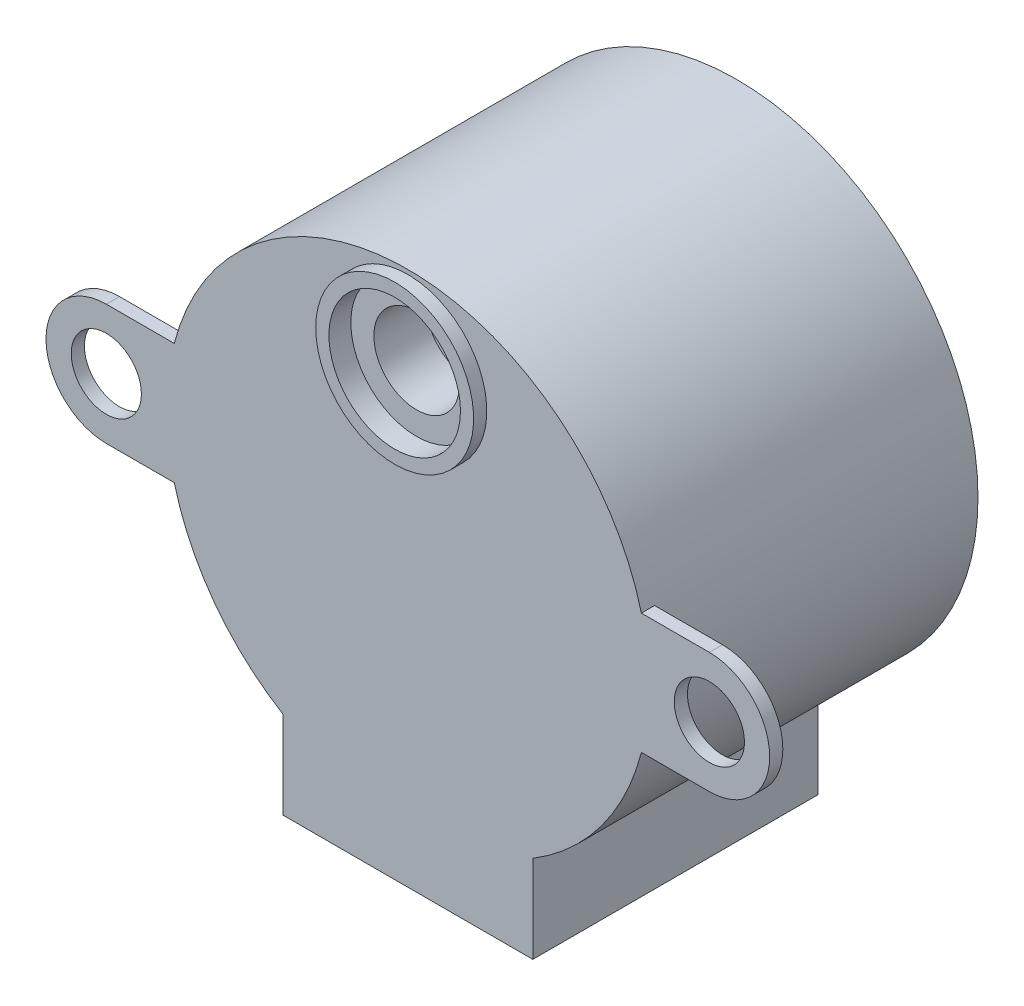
from build123d import *

# Parameters (mm, degrees)
SKETCH1_R           = 13.97
BOSS_EXTRUDE1_DEPTH = 19.05
BOSS_EXTRUDE2_DEPTH = 0.762
SKETCH3_R           = 2.032
CUT_EXTRUDE1_DEPTH  = 32.578084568
SKETCH6_R           = 4.572
BOSS_EXTRUDE3_DEPTH = 0.762
SKETCH7_W           = 14.478
SKETCH7_H           = 5.215434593
BOSS_EXTRUDE4_DEPTH = 16.51
SKETCH8_R           = 3.81
CUT_EXTRUDE6_DEPTH  = 1.27
SKETCH9_R           = 2.4765
CUT_EXTRUDE7_DEPTH  = 3.048


with BuildPart() as part:
    # Sketch1 → Boss-Extrude1 (new body)
    with BuildSketch(Plane.XY):
        with Locations(Location((0, 0, 0), (0, 0, 180))):
            Circle(SKETCH1_R)
    extrude(amount=BOSS_EXTRUDE1_DEPTH)

    # Sketch2 → Boss-Extrude2 (add)
    with BuildSketch(Plane.XY.offset(19.05)):
        with BuildLine():
            Line((17.4625, -3.4925), (-17.4625, -3.4925))
            ThreePointArc((-17.4625, -3.4925), (-20.955, 0), (-17.4625, 3.4925))
            Line((-17.4625, 3.4925), (17.4625, 3.4925))
            ThreePointArc((17.4625, 3.4925), (20.955, 0), (17.4625, -3.4925))
        make_face()
    extrude(amount=-BOSS_EXTRUDE2_DEPTH)

    # Sketch3 → Cut-Extrude1 (cut, through all)
    with BuildSketch(Plane.XY.offset(19.05)):
        with Locations((-17.4625, 0)):
            Circle(SKETCH3_R)
        with Locations((17.4625, 0)):
            Circle(SKETCH3_R)
    extrude(amount=-CUT_EXTRUDE1_DEPTH, mode=Mode.SUBTRACT)

    # Sketch6 → Boss-Extrude3 (add)
    with BuildSketch(Plane.XY.offset(19.05)):
        with Locations(Location((0, 9.144, 0), (0, 0, 180))):
            Circle(SKETCH6_R)
    extrude(amount=BOSS_EXTRUDE3_DEPTH)

    # Sketch7 → Boss-Extrude4 (add)
    with BuildSketch(Plane.XY.offset(19.05)):
        with Locations((0, -14.410282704)):
            Rectangle(SKETCH7_W, SKETCH7_H)
    extrude(amount=-BOSS_EXTRUDE4_DEPTH)

    # Sketch8 → Cut-Extrude6 (cut)
    with BuildSketch(Plane.XY.offset(19.812)):
        with Locations((0, 9.144)):
            Circle(SKETCH8_R)
    extrude(amount=-CUT_EXTRUDE6_DEPTH, mode=Mode.SUBTRACT)

    # Sketch9 → Cut-Extrude7 (cut)
    with BuildSketch(Plane.XY.offset(18.542)):
        with Locations((0, 9.144)):
            Circle(SKETCH9_R)
    extrude(amount=-CUT_EXTRUDE7_DEPTH, mode=Mode.SUBTRACT)


solid = part.part
